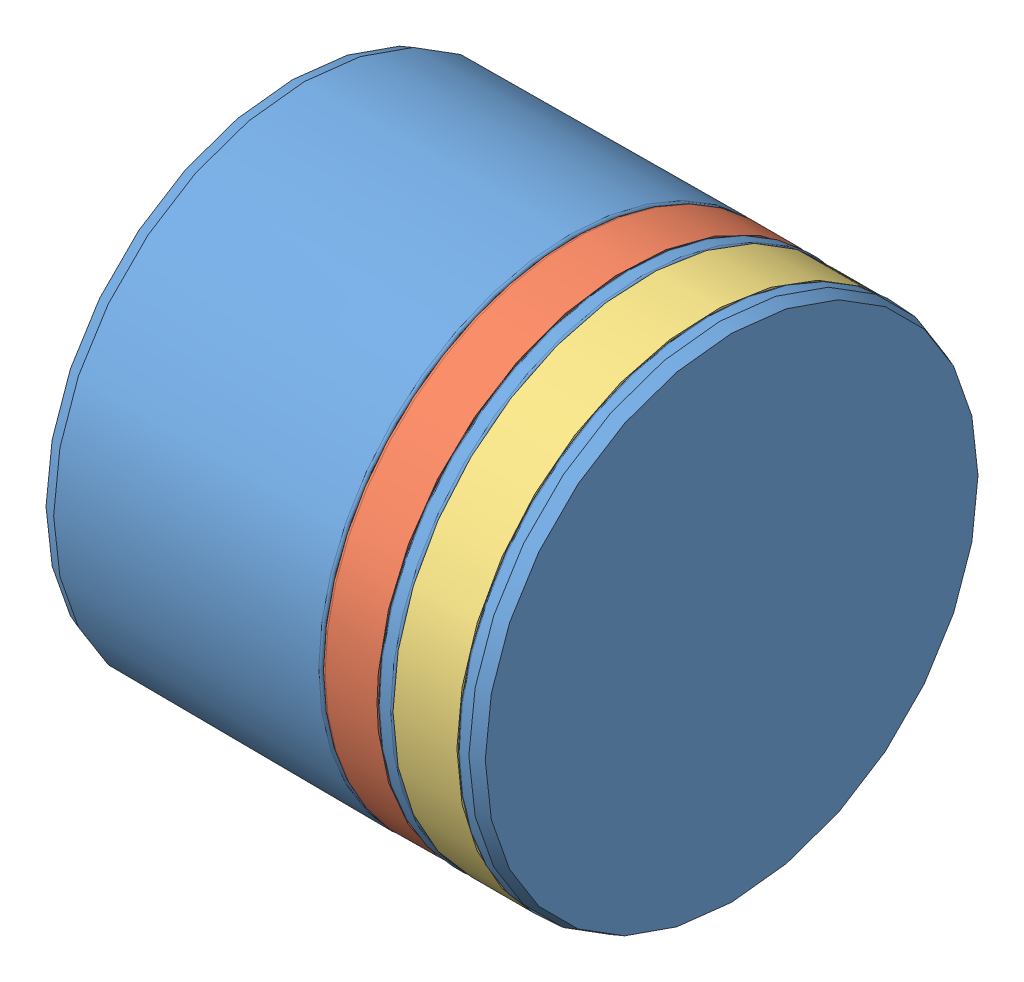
SolidWorks assembly 181 piston avec joint.SLDASM, configuration Default (file format 3100). Lengths in mm.
Overall size (55 62.8 62.8).
3 component instances, 3 part files, 4 mates.
Components (placement in the parent):
- 181 PISTON EMBRAYAGE-1: 181 PISTON EMBRAYAGE.SLDPRT [Défaut] at (-31.2877 13.5934 7.2749) size (55 62.8 62.8)
- 065 -joint de piston-1: 065 -joint de piston.SLDPRT [Default] at (3.7123 13.5934 7.2749) size (7 62.8 62.8)
- 065 bis-joint de piston-1: 065 bis-joint de piston.SLDPRT [Default] at (12.7123 13.5934 7.2749) size (8 62.8 62.8)
Mates (geometry in assembly coordinates):
- Coaxiale1: concentric: cylinder of 181 PISTON EMBRAYAGE-1; cylinder of 065 -joint de piston-1
- Coïncidente1: coincident anti-aligned: plane of 181 PISTON EMBRAYAGE-1; plane of 065 -joint de piston-1
- Coaxiale2: concentric: cylinder of 181 PISTON EMBRAYAGE-1; cylinder of 065 bis-joint de piston-1
- Coïncidente2: coincident anti-aligned: plane of 181 PISTON EMBRAYAGE-1; plane of 065 bis-joint de piston-1
